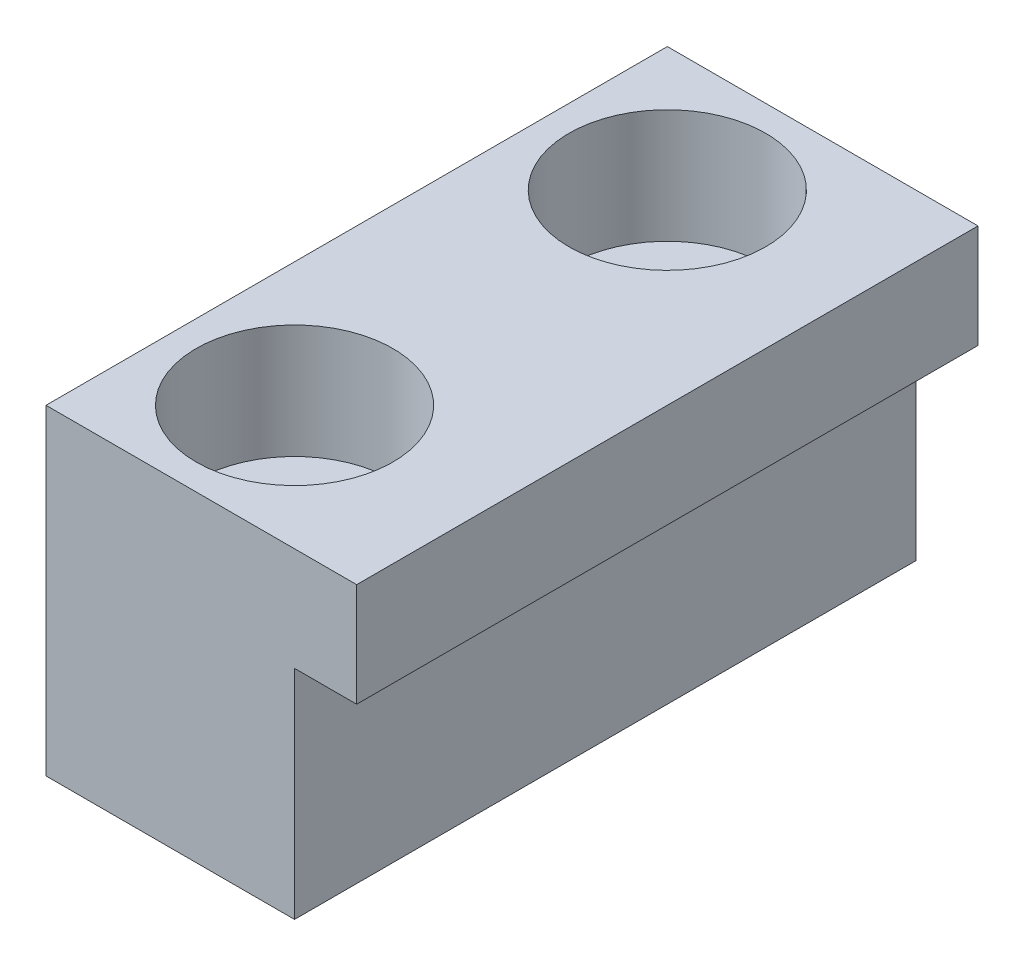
ISO-10303-21;
HEADER;
FILE_DESCRIPTION(('STEP AP214'),'2;1');
FILE_NAME('part.step','',(''),(''),'','','');
FILE_SCHEMA(('AUTOMOTIVE_DESIGN { 1 0 10303 214 1 1 1 1 }'));
ENDSEC;
DATA;
#1=APPLICATION_CONTEXT('core data for automotive mechanical design processes');
#2=APPLICATION_PROTOCOL_DEFINITION('international standard','automotive_design',2000,#1);
#3=PRODUCT_CONTEXT('',#1,'mechanical');
#4=PRODUCT('Part','Part','',(#3));
#5=PRODUCT_RELATED_PRODUCT_CATEGORY('part','',(#4));
#6=PRODUCT_DEFINITION_FORMATION('','',#4);
#7=PRODUCT_DEFINITION_CONTEXT('part definition',#1,'design');
#8=PRODUCT_DEFINITION('design','',#6,#7);
#9=PRODUCT_DEFINITION_SHAPE('','',#8);
#10=(LENGTH_UNIT() NAMED_UNIT(*) SI_UNIT(.MILLI.,.METRE.));
#11=(NAMED_UNIT(*) PLANE_ANGLE_UNIT() SI_UNIT($,.RADIAN.));
#12=(NAMED_UNIT(*) SI_UNIT($,.STERADIAN.) SOLID_ANGLE_UNIT());
#13=UNCERTAINTY_MEASURE_WITH_UNIT(LENGTH_MEASURE(1.E-05),#10,'distance_accuracy_value','');
#14=(GEOMETRIC_REPRESENTATION_CONTEXT(3) GLOBAL_UNCERTAINTY_ASSIGNED_CONTEXT((#13)) GLOBAL_UNIT_ASSIGNED_CONTEXT((#10,
#11,#12)) REPRESENTATION_CONTEXT('',''));
#15=CARTESIAN_POINT('',(0.,0.,0.));
#16=DIRECTION('',(0.,0.,1.));
#17=DIRECTION('',(1.,0.,0.));
#18=AXIS2_PLACEMENT_3D('',#15,#16,#17);
#19=CARTESIAN_POINT('',(6.,-14.5,24.));
#20=DIRECTION('',(0.,1.,0.));
#21=DIRECTION('',(0.,0.,1.));
#22=AXIS2_PLACEMENT_3D('',#19,#20,#21);
#23=CYLINDRICAL_SURFACE('',#22,2.75);
#24=CARTESIAN_POINT('',(6.,0.,24.));
#25=DIRECTION('',(0.,1.,0.));
#26=DIRECTION('',(0.,0.,1.));
#27=AXIS2_PLACEMENT_3D('',#24,#25,#26);
#28=CIRCLE('',#27,2.75);
#29=CARTESIAN_POINT('',(6.,0.,26.75));
#30=VERTEX_POINT('',#29);
#31=EDGE_CURVE('E137',#30,#30,#28,.T.);
#32=ORIENTED_EDGE('',*,*,#31,.F.);
#33=EDGE_LOOP('',(#32));
#34=FACE_BOUND('',#33,.T.);
#35=CARTESIAN_POINT('',(6.,10.,24.));
#36=DIRECTION('',(0.,1.,0.));
#37=DIRECTION('',(0.,0.,1.));
#38=AXIS2_PLACEMENT_3D('',#35,#36,#37);
#39=CIRCLE('',#38,2.75);
#40=CARTESIAN_POINT('',(6.,10.,26.75));
#41=VERTEX_POINT('',#40);
#42=EDGE_CURVE('E36',#41,#41,#39,.F.);
#43=ORIENTED_EDGE('',*,*,#42,.F.);
#44=EDGE_LOOP('',(#43));
#45=FACE_BOUND('',#44,.T.);
#46=ADVANCED_FACE('F32',(#34,#45),#23,.F.);
#47=CARTESIAN_POINT('',(6.,-14.5,6.));
#48=DIRECTION('',(0.,1.,0.));
#49=DIRECTION('',(0.,0.,1.));
#50=AXIS2_PLACEMENT_3D('',#47,#48,#49);
#51=CYLINDRICAL_SURFACE('',#50,2.75);
#52=CARTESIAN_POINT('',(6.,0.,6.));
#53=DIRECTION('',(0.,1.,0.));
#54=DIRECTION('',(0.,0.,1.));
#55=AXIS2_PLACEMENT_3D('',#52,#53,#54);
#56=CIRCLE('',#55,2.75);
#57=CARTESIAN_POINT('',(6.,0.,8.75));
#58=VERTEX_POINT('',#57);
#59=EDGE_CURVE('E123',#58,#58,#56,.T.);
#60=ORIENTED_EDGE('',*,*,#59,.F.);
#61=EDGE_LOOP('',(#60));
#62=FACE_BOUND('',#61,.T.);
#63=CARTESIAN_POINT('',(6.,10.,6.));
#64=DIRECTION('',(0.,1.,0.));
#65=DIRECTION('',(0.,0.,1.));
#66=AXIS2_PLACEMENT_3D('',#63,#64,#65);
#67=CIRCLE('',#66,2.75);
#68=CARTESIAN_POINT('',(6.,10.,8.75));
#69=VERTEX_POINT('',#68);
#70=EDGE_CURVE('E135',#69,#69,#67,.F.);
#71=ORIENTED_EDGE('',*,*,#70,.F.);
#72=EDGE_LOOP('',(#71));
#73=FACE_BOUND('',#72,.T.);
#74=ADVANCED_FACE('F181',(#62,#73),#51,.F.);
#75=CARTESIAN_POINT('',(0.,0.,30.));
#76=DIRECTION('',(1.,0.,0.));
#77=DIRECTION('',(0.,0.,-1.));
#78=AXIS2_PLACEMENT_3D('',#75,#76,#77);
#79=PLANE('',#78);
#80=DIRECTION('',(0.,-1.,0.));
#81=VECTOR('',#80,1.);
#82=CARTESIAN_POINT('',(0.,0.,0.));
#83=LINE('',#82,#81);
#84=CARTESIAN_POINT('',(0.,15.5,0.));
#85=VERTEX_POINT('',#84);
#86=CARTESIAN_POINT('',(0.,0.,0.));
#87=VERTEX_POINT('',#86);
#88=EDGE_CURVE('E119',#85,#87,#83,.T.);
#89=ORIENTED_EDGE('',*,*,#88,.T.);
#90=DIRECTION('',(0.,0.,-1.));
#91=VECTOR('',#90,1.);
#92=CARTESIAN_POINT('',(0.,0.,30.));
#93=LINE('',#92,#91);
#94=CARTESIAN_POINT('',(0.,0.,30.));
#95=VERTEX_POINT('',#94);
#96=EDGE_CURVE('E11',#95,#87,#93,.T.);
#97=ORIENTED_EDGE('',*,*,#96,.F.);
#98=DIRECTION('',(0.,-1.,0.));
#99=VECTOR('',#98,1.);
#100=CARTESIAN_POINT('',(0.,0.,30.));
#101=LINE('',#100,#99);
#102=CARTESIAN_POINT('',(0.,15.5,30.));
#103=VERTEX_POINT('',#102);
#104=EDGE_CURVE('E130',#103,#95,#101,.T.);
#105=ORIENTED_EDGE('',*,*,#104,.F.);
#106=DIRECTION('',(0.,0.,-1.));
#107=VECTOR('',#106,1.);
#108=CARTESIAN_POINT('',(0.,15.5,30.));
#109=LINE('',#108,#107);
#110=EDGE_CURVE('E115',#103,#85,#109,.T.);
#111=ORIENTED_EDGE('',*,*,#110,.T.);
#112=EDGE_LOOP('',(#89,#97,#105,#111));
#113=FACE_BOUND('',#112,.T.);
#114=ADVANCED_FACE('F34',(#113),#79,.F.);
#115=CARTESIAN_POINT('',(0.,0.,30.));
#116=DIRECTION('',(0.,1.,0.));
#117=DIRECTION('',(0.,0.,1.));
#118=AXIS2_PLACEMENT_3D('',#115,#116,#117);
#119=PLANE('',#118);
#120=ORIENTED_EDGE('',*,*,#31,.T.);
#121=EDGE_LOOP('',(#120));
#122=FACE_BOUND('',#121,.T.);
#123=ORIENTED_EDGE('',*,*,#59,.T.);
#124=EDGE_LOOP('',(#123));
#125=FACE_BOUND('',#124,.T.);
#126=DIRECTION('',(1.,0.,0.));
#127=VECTOR('',#126,1.);
#128=CARTESIAN_POINT('',(0.,0.,0.));
#129=LINE('',#128,#127);
#130=CARTESIAN_POINT('',(12.,0.,0.));
#131=VERTEX_POINT('',#130);
#132=EDGE_CURVE('E122',#87,#131,#129,.T.);
#133=ORIENTED_EDGE('',*,*,#132,.T.);
#134=DIRECTION('',(0.,0.,-1.));
#135=VECTOR('',#134,1.);
#136=CARTESIAN_POINT('',(12.,0.,30.));
#137=LINE('',#136,#135);
#138=CARTESIAN_POINT('',(12.,0.,30.));
#139=VERTEX_POINT('',#138);
#140=EDGE_CURVE('E42',#139,#131,#137,.T.);
#141=ORIENTED_EDGE('',*,*,#140,.F.);
#142=DIRECTION('',(1.,0.,0.));
#143=VECTOR('',#142,1.);
#144=CARTESIAN_POINT('',(0.,0.,30.));
#145=LINE('',#144,#143);
#146=EDGE_CURVE('E88',#95,#139,#145,.T.);
#147=ORIENTED_EDGE('',*,*,#146,.F.);
#148=ORIENTED_EDGE('',*,*,#96,.T.);
#149=EDGE_LOOP('',(#133,#141,#147,#148));
#150=FACE_BOUND('',#149,.T.);
#151=ADVANCED_FACE('F159',(#122,#125,#150),#119,.F.);
#152=CARTESIAN_POINT('',(12.,0.,30.));
#153=DIRECTION('',(-1.,0.,0.));
#154=DIRECTION('',(0.,0.,1.));
#155=AXIS2_PLACEMENT_3D('',#152,#153,#154);
#156=PLANE('',#155);
#157=DIRECTION('',(0.,1.,0.));
#158=VECTOR('',#157,1.);
#159=CARTESIAN_POINT('',(12.,0.,0.));
#160=LINE('',#159,#158);
#161=CARTESIAN_POINT('',(12.,10.5,0.));
#162=VERTEX_POINT('',#161);
#163=EDGE_CURVE('E125',#131,#162,#160,.T.);
#164=ORIENTED_EDGE('',*,*,#163,.T.);
#165=DIRECTION('',(0.,0.,-1.));
#166=VECTOR('',#165,1.);
#167=CARTESIAN_POINT('',(12.,10.5,30.));
#168=LINE('',#167,#166);
#169=CARTESIAN_POINT('',(12.,10.5,30.));
#170=VERTEX_POINT('',#169);
#171=EDGE_CURVE('E110',#170,#162,#168,.T.);
#172=ORIENTED_EDGE('',*,*,#171,.F.);
#173=DIRECTION('',(0.,1.,0.));
#174=VECTOR('',#173,1.);
#175=CARTESIAN_POINT('',(12.,0.,30.));
#176=LINE('',#175,#174);
#177=EDGE_CURVE('E101',#139,#170,#176,.T.);
#178=ORIENTED_EDGE('',*,*,#177,.F.);
#179=ORIENTED_EDGE('',*,*,#140,.T.);
#180=EDGE_LOOP('',(#164,#172,#178,#179));
#181=FACE_BOUND('',#180,.T.);
#182=ADVANCED_FACE('F162',(#181),#156,.F.);
#183=CARTESIAN_POINT('',(12.,10.5,30.));
#184=DIRECTION('',(0.,1.,0.));
#185=DIRECTION('',(0.,0.,1.));
#186=AXIS2_PLACEMENT_3D('',#183,#184,#185);
#187=PLANE('',#186);
#188=DIRECTION('',(1.,0.,0.));
#189=VECTOR('',#188,1.);
#190=CARTESIAN_POINT('',(12.,10.5,0.));
#191=LINE('',#190,#189);
#192=CARTESIAN_POINT('',(15.,10.5,0.));
#193=VERTEX_POINT('',#192);
#194=EDGE_CURVE('E109',#162,#193,#191,.T.);
#195=ORIENTED_EDGE('',*,*,#194,.T.);
#196=DIRECTION('',(0.,0.,-1.));
#197=VECTOR('',#196,1.);
#198=CARTESIAN_POINT('',(15.,10.5,30.));
#199=LINE('',#198,#197);
#200=CARTESIAN_POINT('',(15.,10.5,30.));
#201=VERTEX_POINT('',#200);
#202=EDGE_CURVE('E106',#201,#193,#199,.T.);
#203=ORIENTED_EDGE('',*,*,#202,.F.);
#204=DIRECTION('',(1.,0.,0.));
#205=VECTOR('',#204,1.);
#206=CARTESIAN_POINT('',(12.,10.5,30.));
#207=LINE('',#206,#205);
#208=EDGE_CURVE('E95',#170,#201,#207,.T.);
#209=ORIENTED_EDGE('',*,*,#208,.F.);
#210=ORIENTED_EDGE('',*,*,#171,.T.);
#211=EDGE_LOOP('',(#195,#203,#209,#210));
#212=FACE_BOUND('',#211,.T.);
#213=ADVANCED_FACE('F107',(#212),#187,.F.);
#214=CARTESIAN_POINT('',(15.,10.5,30.));
#215=DIRECTION('',(-1.,0.,0.));
#216=DIRECTION('',(0.,0.,1.));
#217=AXIS2_PLACEMENT_3D('',#214,#215,#216);
#218=PLANE('',#217);
#219=DIRECTION('',(0.,1.,0.));
#220=VECTOR('',#219,1.);
#221=CARTESIAN_POINT('',(15.,10.5,0.));
#222=LINE('',#221,#220);
#223=CARTESIAN_POINT('',(15.,15.5,0.));
#224=VERTEX_POINT('',#223);
#225=EDGE_CURVE('E74',#193,#224,#222,.T.);
#226=ORIENTED_EDGE('',*,*,#225,.T.);
#227=DIRECTION('',(0.,0.,-1.));
#228=VECTOR('',#227,1.);
#229=CARTESIAN_POINT('',(15.,15.5,30.));
#230=LINE('',#229,#228);
#231=CARTESIAN_POINT('',(15.,15.5,30.));
#232=VERTEX_POINT('',#231);
#233=EDGE_CURVE('E111',#232,#224,#230,.T.);
#234=ORIENTED_EDGE('',*,*,#233,.F.);
#235=DIRECTION('',(0.,1.,0.));
#236=VECTOR('',#235,1.);
#237=CARTESIAN_POINT('',(15.,10.5,30.));
#238=LINE('',#237,#236);
#239=EDGE_CURVE('E99',#201,#232,#238,.T.);
#240=ORIENTED_EDGE('',*,*,#239,.F.);
#241=ORIENTED_EDGE('',*,*,#202,.T.);
#242=EDGE_LOOP('',(#226,#234,#240,#241));
#243=FACE_BOUND('',#242,.T.);
#244=ADVANCED_FACE('F113',(#243),#218,.F.);
#245=CARTESIAN_POINT('',(0.,15.5,30.));
#246=DIRECTION('',(0.,-1.,0.));
#247=DIRECTION('',(0.,0.,-1.));
#248=AXIS2_PLACEMENT_3D('',#245,#246,#247);
#249=PLANE('',#248);
#250=CARTESIAN_POINT('',(6.,15.5,24.));
#251=DIRECTION('',(0.,1.,0.));
#252=DIRECTION('',(0.,0.,1.));
#253=AXIS2_PLACEMENT_3D('',#250,#251,#252);
#254=CIRCLE('',#253,4.75);
#255=CARTESIAN_POINT('',(6.,15.5,28.75));
#256=VERTEX_POINT('',#255);
#257=EDGE_CURVE('E151',#256,#256,#254,.T.);
#258=ORIENTED_EDGE('',*,*,#257,.F.);
#259=EDGE_LOOP('',(#258));
#260=FACE_BOUND('',#259,.T.);
#261=CARTESIAN_POINT('',(6.,15.5,6.));
#262=DIRECTION('',(0.,1.,0.));
#263=DIRECTION('',(0.,0.,1.));
#264=AXIS2_PLACEMENT_3D('',#261,#262,#263);
#265=CIRCLE('',#264,4.75);
#266=CARTESIAN_POINT('',(6.,15.5,10.75));
#267=VERTEX_POINT('',#266);
#268=EDGE_CURVE('E144',#267,#267,#265,.T.);
#269=ORIENTED_EDGE('',*,*,#268,.F.);
#270=EDGE_LOOP('',(#269));
#271=FACE_BOUND('',#270,.T.);
#272=DIRECTION('',(-1.,0.,0.));
#273=VECTOR('',#272,1.);
#274=CARTESIAN_POINT('',(0.,15.5,0.));
#275=LINE('',#274,#273);
#276=EDGE_CURVE('E80',#224,#85,#275,.T.);
#277=ORIENTED_EDGE('',*,*,#276,.T.);
#278=ORIENTED_EDGE('',*,*,#110,.F.);
#279=DIRECTION('',(-1.,0.,0.));
#280=VECTOR('',#279,1.);
#281=CARTESIAN_POINT('',(0.,15.5,30.));
#282=LINE('',#281,#280);
#283=EDGE_CURVE('E51',#232,#103,#282,.T.);
#284=ORIENTED_EDGE('',*,*,#283,.F.);
#285=ORIENTED_EDGE('',*,*,#233,.T.);
#286=EDGE_LOOP('',(#277,#278,#284,#285));
#287=FACE_BOUND('',#286,.T.);
#288=ADVANCED_FACE('F167',(#260,#271,#287),#249,.F.);
#289=CARTESIAN_POINT('',(0.,15.5,30.));
#290=DIRECTION('',(0.,0.,-1.));
#291=DIRECTION('',(-1.,0.,0.));
#292=AXIS2_PLACEMENT_3D('',#289,#290,#291);
#293=PLANE('',#292);
#294=ORIENTED_EDGE('',*,*,#104,.T.);
#295=ORIENTED_EDGE('',*,*,#146,.T.);
#296=ORIENTED_EDGE('',*,*,#177,.T.);
#297=ORIENTED_EDGE('',*,*,#208,.T.);
#298=ORIENTED_EDGE('',*,*,#239,.T.);
#299=ORIENTED_EDGE('',*,*,#283,.T.);
#300=EDGE_LOOP('',(#294,#295,#296,#297,#298,#299));
#301=FACE_BOUND('',#300,.T.);
#302=ADVANCED_FACE('F97',(#301),#293,.F.);
#303=CARTESIAN_POINT('',(0.,15.5,0.));
#304=DIRECTION('',(0.,0.,-1.));
#305=DIRECTION('',(-1.,0.,0.));
#306=AXIS2_PLACEMENT_3D('',#303,#304,#305);
#307=PLANE('',#306);
#308=ORIENTED_EDGE('',*,*,#88,.F.);
#309=ORIENTED_EDGE('',*,*,#276,.F.);
#310=ORIENTED_EDGE('',*,*,#225,.F.);
#311=ORIENTED_EDGE('',*,*,#194,.F.);
#312=ORIENTED_EDGE('',*,*,#163,.F.);
#313=ORIENTED_EDGE('',*,*,#132,.F.);
#314=EDGE_LOOP('',(#308,#309,#310,#311,#312,#313));
#315=FACE_BOUND('',#314,.T.);
#316=ADVANCED_FACE('F165',(#315),#307,.T.);
#317=CARTESIAN_POINT('',(6.,10.,6.));
#318=DIRECTION('',(0.,1.,0.));
#319=DIRECTION('',(0.,0.,1.));
#320=AXIS2_PLACEMENT_3D('',#317,#318,#319);
#321=PLANE('',#320);
#322=CARTESIAN_POINT('',(6.,10.,6.));
#323=DIRECTION('',(0.,1.,0.));
#324=DIRECTION('',(0.,0.,1.));
#325=AXIS2_PLACEMENT_3D('',#322,#323,#324);
#326=CIRCLE('',#325,4.75);
#327=CARTESIAN_POINT('',(6.,10.,10.75));
#328=VERTEX_POINT('',#327);
#329=EDGE_CURVE('E138',#328,#328,#326,.T.);
#330=ORIENTED_EDGE('',*,*,#329,.T.);
#331=EDGE_LOOP('',(#330));
#332=FACE_BOUND('',#331,.T.);
#333=ORIENTED_EDGE('',*,*,#70,.T.);
#334=EDGE_LOOP('',(#333));
#335=FACE_BOUND('',#334,.T.);
#336=ADVANCED_FACE('F195',(#332,#335),#321,.T.);
#337=CARTESIAN_POINT('',(6.,10.,6.));
#338=DIRECTION('',(0.,1.,0.));
#339=DIRECTION('',(0.,0.,1.));
#340=AXIS2_PLACEMENT_3D('',#337,#338,#339);
#341=CYLINDRICAL_SURFACE('',#340,4.75);
#342=ORIENTED_EDGE('',*,*,#329,.F.);
#343=EDGE_LOOP('',(#342));
#344=FACE_BOUND('',#343,.T.);
#345=ORIENTED_EDGE('',*,*,#268,.T.);
#346=EDGE_LOOP('',(#345));
#347=FACE_BOUND('',#346,.T.);
#348=ADVANCED_FACE('F192',(#344,#347),#341,.F.);
#349=CARTESIAN_POINT('',(6.,10.,24.));
#350=DIRECTION('',(0.,1.,0.));
#351=DIRECTION('',(0.,0.,1.));
#352=AXIS2_PLACEMENT_3D('',#349,#350,#351);
#353=PLANE('',#352);
#354=CARTESIAN_POINT('',(6.,10.,24.));
#355=DIRECTION('',(0.,1.,0.));
#356=DIRECTION('',(0.,0.,1.));
#357=AXIS2_PLACEMENT_3D('',#354,#355,#356);
#358=CIRCLE('',#357,4.75);
#359=CARTESIAN_POINT('',(6.,10.,28.75));
#360=VERTEX_POINT('',#359);
#361=EDGE_CURVE('E216',#360,#360,#358,.T.);
#362=ORIENTED_EDGE('',*,*,#361,.T.);
#363=EDGE_LOOP('',(#362));
#364=FACE_BOUND('',#363,.T.);
#365=ORIENTED_EDGE('',*,*,#42,.T.);
#366=EDGE_LOOP('',(#365));
#367=FACE_BOUND('',#366,.T.);
#368=ADVANCED_FACE('F202',(#364,#367),#353,.T.);
#369=CARTESIAN_POINT('',(6.,10.,24.));
#370=DIRECTION('',(0.,1.,0.));
#371=DIRECTION('',(0.,0.,1.));
#372=AXIS2_PLACEMENT_3D('',#369,#370,#371);
#373=CYLINDRICAL_SURFACE('',#372,4.75);
#374=ORIENTED_EDGE('',*,*,#361,.F.);
#375=EDGE_LOOP('',(#374));
#376=FACE_BOUND('',#375,.T.);
#377=ORIENTED_EDGE('',*,*,#257,.T.);
#378=EDGE_LOOP('',(#377));
#379=FACE_BOUND('',#378,.T.);
#380=ADVANCED_FACE('F205',(#376,#379),#373,.F.);
#381=CLOSED_SHELL('',(#46,#74,#114,#151,#182,#213,#244,#288,#302,#316,#336,#348,#368,#380));
#382=MANIFOLD_SOLID_BREP('B2',#381);
#383=ADVANCED_BREP_SHAPE_REPRESENTATION('',(#18,#382),#14);
#384=SHAPE_DEFINITION_REPRESENTATION(#9,#383);
ENDSEC;
END-ISO-10303-21;
